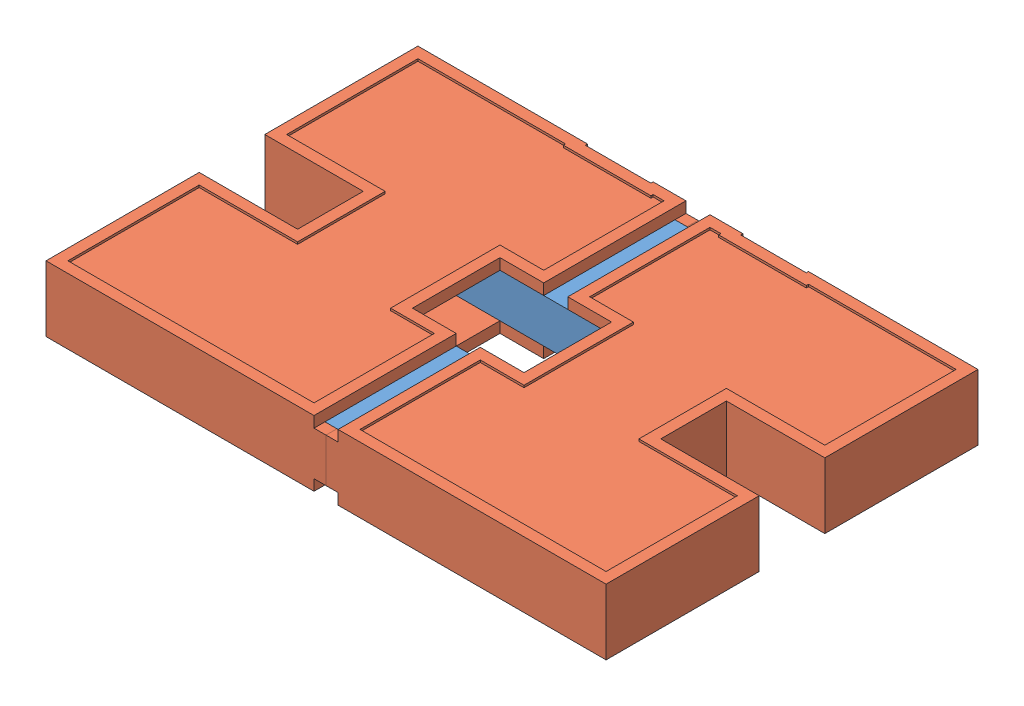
SolidWorks assembly Plaque 5 kg.SLDASM, configuration Défaut (file format 4400). Lengths in mm.
Overall size (256 30 170).
4 component instances, 2 part files, 6 mates.
Components (placement in the parent):
- Plaque 5 kg lame-1: Plaque 5 kg lame.SLDPRT [Défaut] at (40.4358 -3.1373 0) size (236 20 60)
- Plaque 5 kg cache-1: Plaque 5 kg cache.SLDPRT [Défaut] at (-87.5642 -3.1373 -135) x (1 0 0) z (0 -1 0) size (128 170 30)
- Plaque 5 kg lame-2: Plaque 5 kg lame.SLDPRT [Défaut] at (40.4358 -3.1373 -100) size (236 20 60)
- Plaque 5 kg cache-4: Plaque 5 kg cache.SLDPRT [Défaut] at (168.4358 -3.1373 -135) x (-1 0 0) z (0 1 0) size (128 170 30)
Mates (geometry in assembly coordinates):
- Coïncidente1: coincident anti-aligned: plane of Plaque 5 kg lame-1 through (158.4358 6.8627 30) normal (0 0 1); plane of Plaque 5 kg cache-1 through (34.9358 -18.1373 30) normal (0 0 -1)
- Distance1: distance = 5 mm anti-aligned: plane of Plaque 5 kg lame-1 through (-77.5642 6.8627 30) normal (-1 0 0); plane of Plaque 5 kg cache-1 through (-82.5642 -18.1373 35) normal (1 0 0)
- Coïncidente3: coincident anti-aligned: plane of Plaque 5 kg lame-1 through (158.4358 6.8627 -30) normal (0 1 0); plane of Plaque 5 kg cache-1 through (-203.8094 6.8627 -130) normal (0 -1 0)
- Coïncidente4: coincident anti-aligned: plane of Plaque 5 kg cache-1 through (40.4358 -18.1373 30) normal (1 0 0); plane of Plaque 5 kg cache-4 through (40.4358 11.8627 30) normal (-1 0 0)
- Coïncidente5: coincident aligned: plane of Plaque 5 kg cache-1 through (-87.5642 -18.1373 -135) normal (0 0 -1); plane of Plaque 5 kg cache-4 through (168.4358 11.8627 -135) normal (0 0 -1)
- Coïncidente6: coincident aligned: plane of Plaque 5 kg cache-1 through (-23.5642 10.8627 -215.6613) normal (0 1 0); plane of Plaque 5 kg cache-4 through (104.4358 10.8627 -215.6613) normal (0 1 0)
